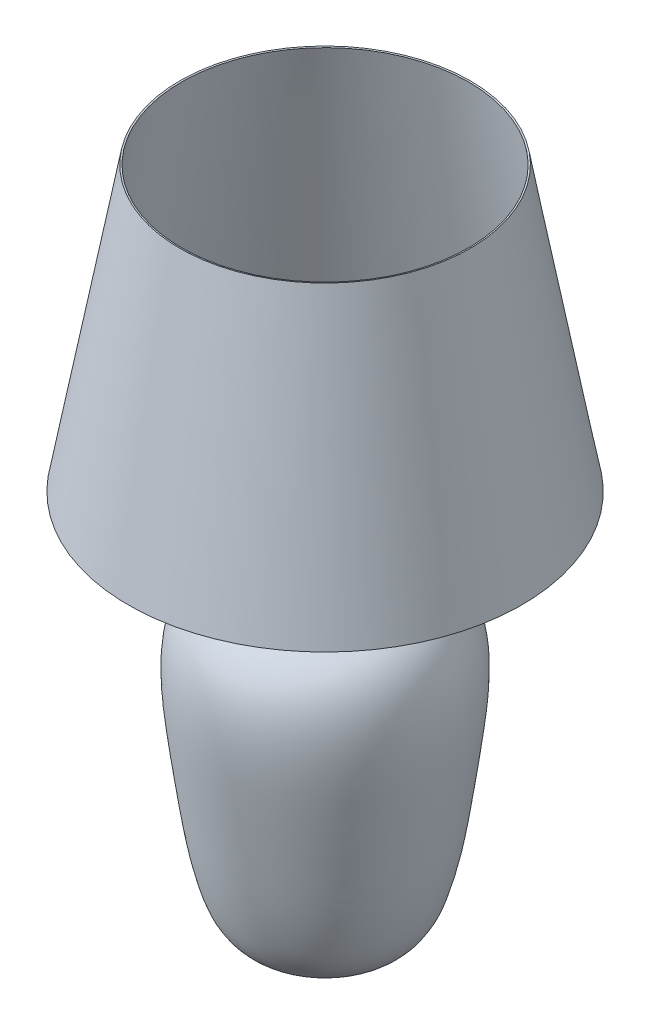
ISO-10303-21;
HEADER;
FILE_DESCRIPTION(('STEP AP214'),'2;1');
FILE_NAME('part.step','',(''),(''),'','','');
FILE_SCHEMA(('AUTOMOTIVE_DESIGN { 1 0 10303 214 1 1 1 1 }'));
ENDSEC;
DATA;
#1=APPLICATION_CONTEXT('core data for automotive mechanical design processes');
#2=APPLICATION_PROTOCOL_DEFINITION('international standard','automotive_design',2000,#1);
#3=PRODUCT_CONTEXT('',#1,'mechanical');
#4=PRODUCT('Part','Part','',(#3));
#5=PRODUCT_RELATED_PRODUCT_CATEGORY('part','',(#4));
#6=PRODUCT_DEFINITION_FORMATION('','',#4);
#7=PRODUCT_DEFINITION_CONTEXT('part definition',#1,'design');
#8=PRODUCT_DEFINITION('design','',#6,#7);
#9=PRODUCT_DEFINITION_SHAPE('','',#8);
#10=(LENGTH_UNIT() NAMED_UNIT(*) SI_UNIT(.MILLI.,.METRE.));
#11=(NAMED_UNIT(*) PLANE_ANGLE_UNIT() SI_UNIT($,.RADIAN.));
#12=(NAMED_UNIT(*) SI_UNIT($,.STERADIAN.) SOLID_ANGLE_UNIT());
#13=UNCERTAINTY_MEASURE_WITH_UNIT(LENGTH_MEASURE(1.E-05),#10,'distance_accuracy_value','');
#14=(GEOMETRIC_REPRESENTATION_CONTEXT(3) GLOBAL_UNCERTAINTY_ASSIGNED_CONTEXT((#13)) GLOBAL_UNIT_ASSIGNED_CONTEXT((#10,
#11,#12)) REPRESENTATION_CONTEXT('',''));
#15=CARTESIAN_POINT('',(0.,0.,0.));
#16=DIRECTION('',(0.,0.,1.));
#17=DIRECTION('',(1.,0.,0.));
#18=AXIS2_PLACEMENT_3D('',#15,#16,#17);
#19=CARTESIAN_POINT('',(1816.946374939,1110.95988926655,0.));
#20=DIRECTION('',(0.,-1.,0.));
#21=DIRECTION('',(0.,0.,-1.));
#22=AXIS2_PLACEMENT_3D('',#19,#20,#21);
#23=CONICAL_SURFACE('',#22,361.458476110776,0.179966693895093);
#24=CARTESIAN_POINT('',(1816.946374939,1632.82096761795,0.));
#25=DIRECTION('',(0.,-1.,0.));
#26=DIRECTION('',(0.,0.,-1.));
#27=AXIS2_PLACEMENT_3D('',#24,#25,#26);
#28=CIRCLE('',#27,266.513618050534);
#29=CARTESIAN_POINT('',(1816.946374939,1632.82096761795,-266.513618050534));
#30=VERTEX_POINT('',#29);
#31=EDGE_CURVE('E10',#30,#30,#28,.T.);
#32=ORIENTED_EDGE('',*,*,#31,.F.);
#33=EDGE_LOOP('',(#32));
#34=FACE_BOUND('',#33,.T.);
#35=CARTESIAN_POINT('',(1816.946374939,1110.95988926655,0.));
#36=DIRECTION('',(0.,-1.,0.));
#37=DIRECTION('',(0.,0.,-1.));
#38=AXIS2_PLACEMENT_3D('',#35,#36,#37);
#39=CIRCLE('',#38,361.458476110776);
#40=CARTESIAN_POINT('',(1816.946374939,1110.95988926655,-361.458476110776));
#41=VERTEX_POINT('',#40);
#42=EDGE_CURVE('E71',#41,#41,#39,.T.);
#43=ORIENTED_EDGE('',*,*,#42,.T.);
#44=EDGE_LOOP('',(#43));
#45=FACE_BOUND('',#44,.T.);
#46=ADVANCED_FACE('F31',(#34,#45),#23,.F.);
#47=CARTESIAN_POINT('',(1816.946374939,1633.35795803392,0.));
#48=DIRECTION('',(0.,1.,0.));
#49=DIRECTION('',(0.,0.,1.));
#50=AXIS2_PLACEMENT_3D('',#47,#48,#49);
#51=CONICAL_SURFACE('',#50,269.465167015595,1.39082963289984);
#52=ORIENTED_EDGE('',*,*,#31,.T.);
#53=EDGE_LOOP('',(#52));
#54=FACE_BOUND('',#53,.T.);
#55=CARTESIAN_POINT('',(1816.946374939,1633.35795803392,0.));
#56=DIRECTION('',(0.,-1.,0.));
#57=DIRECTION('',(0.,0.,-1.));
#58=AXIS2_PLACEMENT_3D('',#55,#56,#57);
#59=CIRCLE('',#58,269.465167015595);
#60=CARTESIAN_POINT('',(1816.946374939,1633.35795803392,-269.465167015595));
#61=VERTEX_POINT('',#60);
#62=EDGE_CURVE('E37',#61,#61,#59,.T.);
#63=ORIENTED_EDGE('',*,*,#62,.F.);
#64=EDGE_LOOP('',(#63));
#65=FACE_BOUND('',#64,.T.);
#66=ADVANCED_FACE('F118',(#54,#65),#51,.F.);
#67=CARTESIAN_POINT('',(1816.946374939,1107.95988926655,0.));
#68=DIRECTION('',(0.,-1.,0.));
#69=DIRECTION('',(0.,0.,-1.));
#70=AXIS2_PLACEMENT_3D('',#67,#68,#69);
#71=CONICAL_SURFACE('',#70,365.053527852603,0.179966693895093);
#72=ORIENTED_EDGE('',*,*,#62,.T.);
#73=EDGE_LOOP('',(#72));
#74=FACE_BOUND('',#73,.T.);
#75=CARTESIAN_POINT('',(1816.946374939,1107.95988926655,0.));
#76=DIRECTION('',(0.,-1.,0.));
#77=DIRECTION('',(0.,0.,-1.));
#78=AXIS2_PLACEMENT_3D('',#75,#76,#77);
#79=CIRCLE('',#78,365.053527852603);
#80=CARTESIAN_POINT('',(1816.946374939,1107.95988926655,-365.053527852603));
#81=VERTEX_POINT('',#80);
#82=EDGE_CURVE('E41',#81,#81,#79,.T.);
#83=ORIENTED_EDGE('',*,*,#82,.F.);
#84=EDGE_LOOP('',(#83));
#85=FACE_BOUND('',#84,.T.);
#86=ADVANCED_FACE('F115',(#74,#85),#71,.T.);
#87=CARTESIAN_POINT('',(1791.55197608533,1107.95988926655,0.));
#88=DIRECTION('',(0.,-1.,0.));
#89=DIRECTION('',(0.,0.,-1.));
#90=AXIS2_PLACEMENT_3D('',#87,#88,#89);
#91=PLANE('',#90);
#92=ORIENTED_EDGE('',*,*,#82,.T.);
#93=EDGE_LOOP('',(#92));
#94=FACE_BOUND('',#93,.T.);
#95=CARTESIAN_POINT('',(1816.946374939,1107.95988926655,0.));
#96=DIRECTION('',(0.,-1.,0.));
#97=DIRECTION('',(0.,0.,-1.));
#98=AXIS2_PLACEMENT_3D('',#95,#96,#97);
#99=CIRCLE('',#98,25.3943988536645);
#100=CARTESIAN_POINT('',(1816.946374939,1107.95988926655,-25.3943988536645));
#101=VERTEX_POINT('',#100);
#102=EDGE_CURVE('E45',#101,#101,#99,.T.);
#103=ORIENTED_EDGE('',*,*,#102,.F.);
#104=EDGE_LOOP('',(#103));
#105=FACE_BOUND('',#104,.T.);
#106=ADVANCED_FACE('F111',(#94,#105),#91,.T.);
#107=CARTESIAN_POINT('',(1816.946374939,405.20764266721,0.));
#108=DIRECTION('',(0.,-1.,0.));
#109=DIRECTION('',(0.,0.,-1.));
#110=AXIS2_PLACEMENT_3D('',#107,#108,#109);
#111=CYLINDRICAL_SURFACE('',#110,25.3943988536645);
#112=ORIENTED_EDGE('',*,*,#102,.T.);
#113=EDGE_LOOP('',(#112));
#114=FACE_BOUND('',#113,.T.);
#115=CARTESIAN_POINT('',(1816.946374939,1022.0462138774,0.));
#116=DIRECTION('',(0.,-1.,0.));
#117=DIRECTION('',(0.,0.,-1.));
#118=AXIS2_PLACEMENT_3D('',#115,#116,#117);
#119=CIRCLE('',#118,25.3943988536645);
#120=CARTESIAN_POINT('',(1816.946374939,1022.0462138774,-25.3943988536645));
#121=VERTEX_POINT('',#120);
#122=EDGE_CURVE('E50',#121,#121,#119,.T.);
#123=ORIENTED_EDGE('',*,*,#122,.F.);
#124=EDGE_LOOP('',(#123));
#125=FACE_BOUND('',#124,.T.);
#126=ADVANCED_FACE('F107',(#114,#125),#111,.T.);
#127=CARTESIAN_POINT('',(1736.62847563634,1022.0462138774,0.));
#128=DIRECTION('',(0.,1.,0.));
#129=DIRECTION('',(0.,0.,1.));
#130=AXIS2_PLACEMENT_3D('',#127,#128,#129);
#131=PLANE('',#130);
#132=ORIENTED_EDGE('',*,*,#122,.T.);
#133=EDGE_LOOP('',(#132));
#134=FACE_BOUND('',#133,.T.);
#135=CARTESIAN_POINT('',(1816.946374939,1022.0462138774,0.));
#136=DIRECTION('',(0.,-1.,0.));
#137=DIRECTION('',(0.,0.,-1.));
#138=AXIS2_PLACEMENT_3D('',#135,#136,#137);
#139=CIRCLE('',#138,80.3178993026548);
#140=CARTESIAN_POINT('',(1816.946374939,1022.0462138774,-80.3178993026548));
#141=VERTEX_POINT('',#140);
#142=EDGE_CURVE('E53',#141,#141,#139,.T.);
#143=ORIENTED_EDGE('',*,*,#142,.F.);
#144=EDGE_LOOP('',(#143));
#145=FACE_BOUND('',#144,.T.);
#146=ADVANCED_FACE('F103',(#134,#145),#131,.T.);
#147=CARTESIAN_POINT('',(1705.05098051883,405.20764266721,0.));
#148=CARTESIAN_POINT('',(1672.61569999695,425.135384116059,0.));
#149=CARTESIAN_POINT('',(1641.87390120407,499.580784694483,0.));
#150=CARTESIAN_POINT('',(1624.15865329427,616.112048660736,0.));
#151=CARTESIAN_POINT('',(1603.35846805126,764.990093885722,0.));
#152=CARTESIAN_POINT('',(1586.05817702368,938.944999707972,0.));
#153=CARTESIAN_POINT('',(1693.60459490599,978.442721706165,0.));
#154=CARTESIAN_POINT('',(1730.94580519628,991.928979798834,0.));
#155=CARTESIAN_POINT('',(1737.96943208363,1002.34757839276,0.));
#156=CARTESIAN_POINT('',(1736.62847563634,1022.0462138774,0.));
#157=B_SPLINE_CURVE_WITH_KNOTS('',3,(#147,#148,#149,#150,#151,#152,#153,#154,#155,#156),
.UNSPECIFIED.,.F.,.F.,(4,1,1,1,1,1,1,4),(0.,0.142045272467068,0.354962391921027,
0.496006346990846,0.825229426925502,0.93411592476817,0.95159298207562,1.),.UNSPECIFIED.);
#158=CARTESIAN_POINT('',(1816.946374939,405.20764266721,0.));
#159=DIRECTION('',(0.,-1.,0.));
#160=AXIS1_PLACEMENT('',#158,#159);
#161=SURFACE_OF_REVOLUTION('',#157,#160);
#162=ORIENTED_EDGE('',*,*,#142,.T.);
#163=EDGE_LOOP('',(#162));
#164=FACE_BOUND('',#163,.T.);
#165=CARTESIAN_POINT('',(1816.946374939,405.20764266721,0.));
#166=DIRECTION('',(0.,-1.,0.));
#167=DIRECTION('',(0.,0.,-1.));
#168=AXIS2_PLACEMENT_3D('',#165,#166,#167);
#169=CIRCLE('',#168,111.895394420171);
#170=CARTESIAN_POINT('',(1816.946374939,405.20764266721,-111.895394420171));
#171=VERTEX_POINT('',#170);
#172=EDGE_CURVE('E56',#171,#171,#169,.T.);
#173=ORIENTED_EDGE('',*,*,#172,.F.);
#174=EDGE_LOOP('',(#173));
#175=FACE_BOUND('',#174,.T.);
#176=ADVANCED_FACE('F99',(#164,#175),#161,.F.);
#177=CARTESIAN_POINT('',(1705.05098051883,405.20764266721,0.));
#178=DIRECTION('',(0.,-1.,0.));
#179=DIRECTION('',(0.,0.,-1.));
#180=AXIS2_PLACEMENT_3D('',#177,#178,#179);
#181=PLANE('',#180);
#182=ORIENTED_EDGE('',*,*,#172,.T.);
#183=EDGE_LOOP('',(#182));
#184=FACE_BOUND('',#183,.T.);
#185=ADVANCED_FACE('F95',(#184),#181,.T.);
#186=CARTESIAN_POINT('',(1705.05098051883,408.20764266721,0.));
#187=DIRECTION('',(0.,-1.,0.));
#188=DIRECTION('',(0.,0.,-1.));
#189=AXIS2_PLACEMENT_3D('',#186,#187,#188);
#190=PLANE('',#189);
#191=CARTESIAN_POINT('',(1816.946374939,408.20764266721,0.));
#192=DIRECTION('',(0.,-1.,0.));
#193=DIRECTION('',(0.,0.,-1.));
#194=AXIS2_PLACEMENT_3D('',#191,#192,#193);
#195=CIRCLE('',#194,111.041356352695);
#196=CARTESIAN_POINT('',(1816.946374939,408.20764266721,-111.041356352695));
#197=VERTEX_POINT('',#196);
#198=EDGE_CURVE('E59',#197,#197,#195,.T.);
#199=ORIENTED_EDGE('',*,*,#198,.F.);
#200=EDGE_LOOP('',(#199));
#201=FACE_BOUND('',#200,.T.);
#202=ADVANCED_FACE('F90',(#201),#190,.F.);
#203=CARTESIAN_POINT('',(1705.9050185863,408.20764266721,0.));
#204=CARTESIAN_POINT('',(1699.04808190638,412.492291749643,0.));
#205=CARTESIAN_POINT('',(1693.1466823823,417.221169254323,0.));
#206=CARTESIAN_POINT('',(1682.85457213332,427.418596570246,0.));
#207=CARTESIAN_POINT('',(1678.46324153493,432.888420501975,0.));
#208=CARTESIAN_POINT('',(1670.8186130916,444.435775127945,0.));
#209=CARTESIAN_POINT('',(1667.56610586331,450.51389488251,0.));
#210=CARTESIAN_POINT('',(1661.85319942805,463.126972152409,0.));
#211=CARTESIAN_POINT('',(1659.39338689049,469.661555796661,0.));
#212=CARTESIAN_POINT('',(1656.03873831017,479.677468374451,0.));
#213=CARTESIAN_POINT('',(1654.9763176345,483.051674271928,0.));
#214=CARTESIAN_POINT('',(1652.91896622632,489.849130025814,0.));
#215=CARTESIAN_POINT('',(1651.92442967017,493.26725611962,0.));
#216=CARTESIAN_POINT('',(1649.03772780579,503.567657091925,0.));
#217=CARTESIAN_POINT('',(1647.24198100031,510.498471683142,0.));
#218=CARTESIAN_POINT('',(1642.18741915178,531.431708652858,0.));
#219=CARTESIAN_POINT('',(1639.26135398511,545.574907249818,0.));
#220=CARTESIAN_POINT('',(1634.00937482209,573.965356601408,0.));
#221=CARTESIAN_POINT('',(1631.68344494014,588.212574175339,0.));
#222=CARTESIAN_POINT('',(1628.42773748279,609.458527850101,0.));
#223=CARTESIAN_POINT('',(1627.38135178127,616.519710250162,0.));
#224=CARTESIAN_POINT('',(1625.84281007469,627.055034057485,0.));
#225=CARTESIAN_POINT('',(1625.33499528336,630.557252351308,0.));
#226=CARTESIAN_POINT('',(1624.32584326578,637.539215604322,0.));
#227=CARTESIAN_POINT('',(1623.82479784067,641.019994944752,0.));
#228=CARTESIAN_POINT('',(1621.33538973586,658.402778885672,0.));
#229=CARTESIAN_POINT('',(1619.39449108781,672.241397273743,0.));
#230=CARTESIAN_POINT('',(1616.52377257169,693.472601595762,0.));
#231=CARTESIAN_POINT('',(1615.57363650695,700.628559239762,0.));
#232=CARTESIAN_POINT('',(1613.6810118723,715.194111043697,0.));
#233=CARTESIAN_POINT('',(1612.73783799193,722.605756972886,0.));
#234=CARTESIAN_POINT('',(1609.91532800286,745.351725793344,0.));
#235=CARTESIAN_POINT('',(1608.06434812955,761.147544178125,0.));
#236=CARTESIAN_POINT('',(1605.30720453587,793.029284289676,0.));
#237=CARTESIAN_POINT('',(1604.40136381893,809.115118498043,0.));
#238=CARTESIAN_POINT('',(1604.41002728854,840.587050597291,0.));
#239=CARTESIAN_POINT('',(1605.32541035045,855.972722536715,0.));
#240=CARTESIAN_POINT('',(1609.82713118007,885.042984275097,0.));
#241=CARTESIAN_POINT('',(1613.41375545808,898.724292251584,0.));
#242=CARTESIAN_POINT('',(1621.3958262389,917.2433423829,0.));
#243=CARTESIAN_POINT('',(1624.48956825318,923.083214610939,0.));
#244=CARTESIAN_POINT('',(1631.64420304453,933.990910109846,0.));
#245=CARTESIAN_POINT('',(1635.70470733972,939.058993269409,0.));
#246=CARTESIAN_POINT('',(1642.6063198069,946.010724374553,0.));
#247=CARTESIAN_POINT('',(1645.0413387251,948.218810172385,0.));
#248=CARTESIAN_POINT('',(1650.20159861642,952.409606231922,0.));
#249=CARTESIAN_POINT('',(1652.93205529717,954.398765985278,0.));
#250=CARTESIAN_POINT('',(1661.49690926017,960.082356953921,0.));
#251=CARTESIAN_POINT('',(1667.70511267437,963.492217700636,0.));
#252=CARTESIAN_POINT('',(1680.68371542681,969.750028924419,0.));
#253=CARTESIAN_POINT('',(1687.4535174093,972.598136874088,0.));
#254=CARTESIAN_POINT('',(1697.69976675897,976.609088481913,0.));
#255=CARTESIAN_POINT('',(1701.13046049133,977.902649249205,0.));
#256=CARTESIAN_POINT('',(1706.25866001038,979.79872568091,0.));
#257=CARTESIAN_POINT('',(1707.96509015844,980.423379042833,0.));
#258=CARTESIAN_POINT('',(1710.51522572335,981.351957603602,0.));
#259=CARTESIAN_POINT('',(1711.36368627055,981.660083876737,0.));
#260=CARTESIAN_POINT('',(1713.05659940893,982.273983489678,0.));
#261=CARTESIAN_POINT('',(1713.89946693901,982.578904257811,0.));
#262=CARTESIAN_POINT('',(1716.43340270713,983.49732909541,0.));
#263=CARTESIAN_POINT('',(1718.13123553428,984.117877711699,0.));
#264=CARTESIAN_POINT('',(1721.47100806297,985.453637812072,0.));
#265=CARTESIAN_POINT('',(1723.11326059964,986.168625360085,0.));
#266=CARTESIAN_POINT('',(1726.27063691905,987.786625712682,0.));
#267=CARTESIAN_POINT('',(1727.7815154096,988.689280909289,0.));
#268=CARTESIAN_POINT('',(1730.6121470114,990.775905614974,0.));
#269=CARTESIAN_POINT('',(1731.93262488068,991.961768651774,0.));
#270=CARTESIAN_POINT('',(1734.30830501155,994.684768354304,0.));
#271=CARTESIAN_POINT('',(1735.36141570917,996.220933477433,0.));
#272=CARTESIAN_POINT('',(1737.14117988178,999.666001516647,0.));
#273=CARTESIAN_POINT('',(1737.86833153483,1001.57297046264,0.));
#274=CARTESIAN_POINT('',(1738.98676471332,1005.79036423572,0.));
#275=CARTESIAN_POINT('',(1739.37930613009,1008.10109664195,0.));
#276=CARTESIAN_POINT('',(1739.83331721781,1013.19610144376,0.));
#277=CARTESIAN_POINT('',(1739.89499940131,1015.981078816,0.));
#278=CARTESIAN_POINT('',(1739.78804294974,1019.0462138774,0.));
#279=B_SPLINE_CURVE_WITH_KNOTS('',3,(#203,#204,#205,#206,#207,#208,#209,#210,#211,#212,#213,
#214,#215,#216,#217,#218,#219,#220,#221,#222,#223,#224,#225,#226,#227,#228,#229,#230,#231,#232,
#233,#234,#235,#236,#237,#238,#239,#240,#241,#242,#243,#244,#245,#246,#247,#248,#249,#250,#251,
#252,#253,#254,#255,#256,#257,#258,#259,#260,#261,#262,#263,#264,#265,#266,#267,#268,#269,#270,
#271,#272,#273,#274,#275,#276,#277,#278),.UNSPECIFIED.,.F.,.F.,(4,2,2,2,2,2,2,2,2,2,2,2,2,2,2,2,
2,2,2,2,2,2,2,2,2,2,2,2,2,2,2,2,2,2,2,2,2,4),(0.,0.0312500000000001,0.0625000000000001,
0.0937500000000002,0.125,0.140625,0.15625,0.187500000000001,0.250000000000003,0.312500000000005,
0.343750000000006,0.359375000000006,0.375000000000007,0.437500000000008,0.468750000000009,
0.500000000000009,0.562500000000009,0.62500000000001,0.687500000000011,0.750000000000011,
0.781250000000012,0.812500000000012,0.828125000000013,0.843750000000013,0.875000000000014,
0.906250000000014,0.921875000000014,0.929687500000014,0.933593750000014,0.937500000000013,
0.945312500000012,0.95312500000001,0.960937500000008,0.968750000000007,0.976562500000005,
0.984375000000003,0.992187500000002,1.),.UNSPECIFIED.);
#280=CARTESIAN_POINT('',(1816.946374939,405.20764266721,0.));
#281=DIRECTION('',(0.,-1.,0.));
#282=AXIS1_PLACEMENT('',#280,#281);
#283=SURFACE_OF_REVOLUTION('',#279,#282);
#284=CARTESIAN_POINT('',(1816.946374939,1019.0462138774,0.));
#285=DIRECTION('',(0.,-1.,0.));
#286=DIRECTION('',(0.,0.,-1.));
#287=AXIS2_PLACEMENT_3D('',#284,#285,#286);
#288=CIRCLE('',#287,77.1583319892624);
#289=CARTESIAN_POINT('',(1816.946374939,1019.0462138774,-77.1583319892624));
#290=VERTEX_POINT('',#289);
#291=EDGE_CURVE('E62',#290,#290,#288,.T.);
#292=ORIENTED_EDGE('',*,*,#291,.F.);
#293=EDGE_LOOP('',(#292));
#294=FACE_BOUND('',#293,.T.);
#295=ORIENTED_EDGE('',*,*,#198,.T.);
#296=EDGE_LOOP('',(#295));
#297=FACE_BOUND('',#296,.T.);
#298=ADVANCED_FACE('F85',(#294,#297),#283,.T.);
#299=CARTESIAN_POINT('',(1736.62847563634,1019.0462138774,0.));
#300=DIRECTION('',(0.,1.,0.));
#301=DIRECTION('',(0.,0.,1.));
#302=AXIS2_PLACEMENT_3D('',#299,#300,#301);
#303=PLANE('',#302);
#304=CARTESIAN_POINT('',(1816.946374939,1019.0462138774,0.));
#305=DIRECTION('',(0.,-1.,0.));
#306=DIRECTION('',(0.,0.,-1.));
#307=AXIS2_PLACEMENT_3D('',#304,#305,#306);
#308=CIRCLE('',#307,22.3943988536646);
#309=CARTESIAN_POINT('',(1816.946374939,1019.0462138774,-22.3943988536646));
#310=VERTEX_POINT('',#309);
#311=EDGE_CURVE('E65',#310,#310,#308,.T.);
#312=ORIENTED_EDGE('',*,*,#311,.F.);
#313=EDGE_LOOP('',(#312));
#314=FACE_BOUND('',#313,.T.);
#315=ORIENTED_EDGE('',*,*,#291,.T.);
#316=EDGE_LOOP('',(#315));
#317=FACE_BOUND('',#316,.T.);
#318=ADVANCED_FACE('F89',(#314,#317),#303,.F.);
#319=CARTESIAN_POINT('',(1816.946374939,405.20764266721,0.));
#320=DIRECTION('',(0.,-1.,0.));
#321=DIRECTION('',(0.,0.,-1.));
#322=AXIS2_PLACEMENT_3D('',#319,#320,#321);
#323=CYLINDRICAL_SURFACE('',#322,22.3943988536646);
#324=CARTESIAN_POINT('',(1816.946374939,1110.95988926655,0.));
#325=DIRECTION('',(0.,-1.,0.));
#326=DIRECTION('',(0.,0.,-1.));
#327=AXIS2_PLACEMENT_3D('',#324,#325,#326);
#328=CIRCLE('',#327,22.3943988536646);
#329=CARTESIAN_POINT('',(1816.946374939,1110.95988926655,-22.3943988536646));
#330=VERTEX_POINT('',#329);
#331=EDGE_CURVE('E68',#330,#330,#328,.T.);
#332=ORIENTED_EDGE('',*,*,#331,.F.);
#333=EDGE_LOOP('',(#332));
#334=FACE_BOUND('',#333,.T.);
#335=ORIENTED_EDGE('',*,*,#311,.T.);
#336=EDGE_LOOP('',(#335));
#337=FACE_BOUND('',#336,.T.);
#338=ADVANCED_FACE('F133',(#334,#337),#323,.F.);
#339=CARTESIAN_POINT('',(1791.55197608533,1110.95988926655,0.));
#340=DIRECTION('',(0.,-1.,0.));
#341=DIRECTION('',(0.,0.,-1.));
#342=AXIS2_PLACEMENT_3D('',#339,#340,#341);
#343=PLANE('',#342);
#344=ORIENTED_EDGE('',*,*,#42,.F.);
#345=EDGE_LOOP('',(#344));
#346=FACE_BOUND('',#345,.T.);
#347=ORIENTED_EDGE('',*,*,#331,.T.);
#348=EDGE_LOOP('',(#347));
#349=FACE_BOUND('',#348,.T.);
#350=ADVANCED_FACE('F130',(#346,#349),#343,.F.);
#351=CLOSED_SHELL('',(#46,#66,#86,#106,#126,#146,#176,#185,#202,#298,#318,#338,#350));
#352=MANIFOLD_SOLID_BREP('B2',#351);
#353=ADVANCED_BREP_SHAPE_REPRESENTATION('',(#18,#352),#14);
#354=SHAPE_DEFINITION_REPRESENTATION(#9,#353);
ENDSEC;
END-ISO-10303-21;
